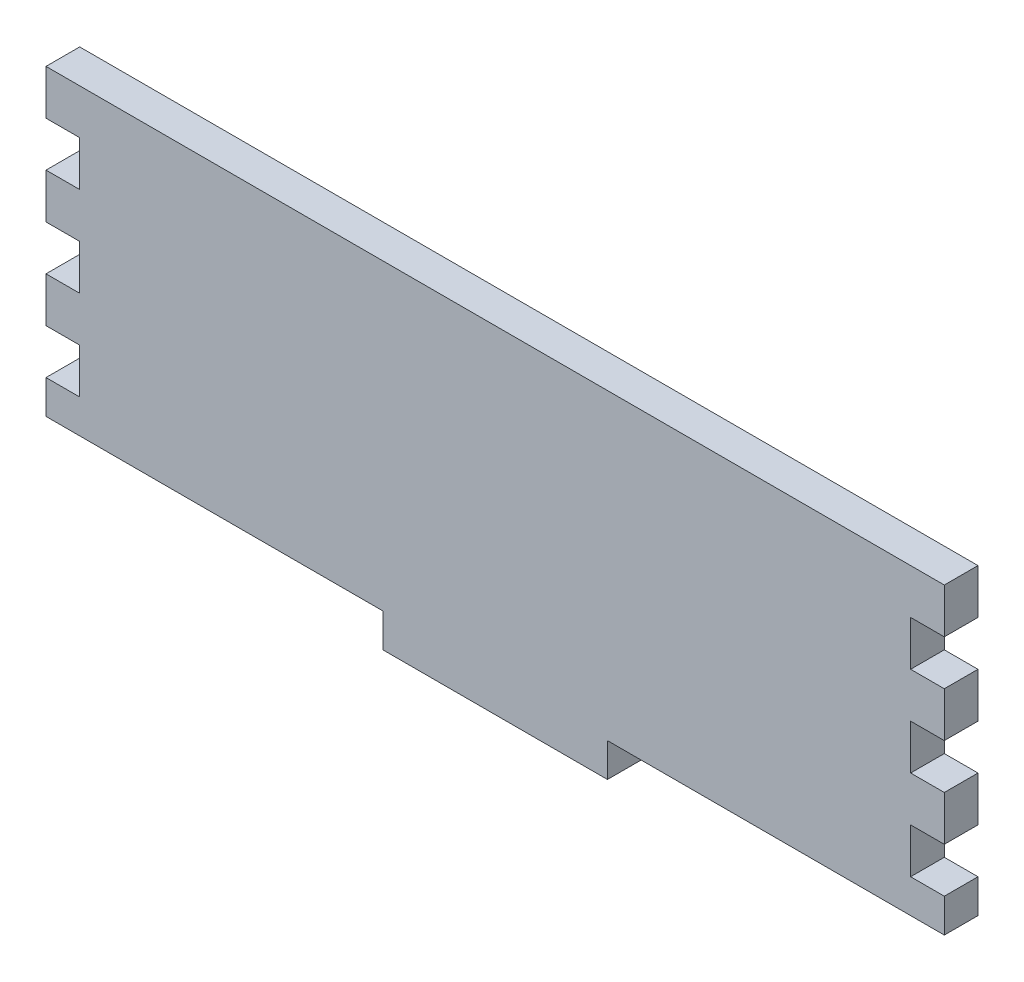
ISO-10303-21;
HEADER;
FILE_DESCRIPTION(('STEP AP214'),'2;1');
FILE_NAME('part.step','',(''),(''),'','','');
FILE_SCHEMA(('AUTOMOTIVE_DESIGN { 1 0 10303 214 1 1 1 1 }'));
ENDSEC;
DATA;
#1=APPLICATION_CONTEXT('core data for automotive mechanical design processes');
#2=APPLICATION_PROTOCOL_DEFINITION('international standard','automotive_design',2000,#1);
#3=PRODUCT_CONTEXT('',#1,'mechanical');
#4=PRODUCT('Part','Part','',(#3));
#5=PRODUCT_RELATED_PRODUCT_CATEGORY('part','',(#4));
#6=PRODUCT_DEFINITION_FORMATION('','',#4);
#7=PRODUCT_DEFINITION_CONTEXT('part definition',#1,'design');
#8=PRODUCT_DEFINITION('design','',#6,#7);
#9=PRODUCT_DEFINITION_SHAPE('','',#8);
#10=(LENGTH_UNIT() NAMED_UNIT(*) SI_UNIT(.MILLI.,.METRE.));
#11=(NAMED_UNIT(*) PLANE_ANGLE_UNIT() SI_UNIT($,.RADIAN.));
#12=(NAMED_UNIT(*) SI_UNIT($,.STERADIAN.) SOLID_ANGLE_UNIT());
#13=UNCERTAINTY_MEASURE_WITH_UNIT(LENGTH_MEASURE(1.E-05),#10,'distance_accuracy_value','');
#14=(GEOMETRIC_REPRESENTATION_CONTEXT(3) GLOBAL_UNCERTAINTY_ASSIGNED_CONTEXT((#13)) GLOBAL_UNIT_ASSIGNED_CONTEXT((#10,
#11,#12)) REPRESENTATION_CONTEXT('',''));
#15=CARTESIAN_POINT('',(0.,0.,0.));
#16=DIRECTION('',(0.,0.,1.));
#17=DIRECTION('',(1.,0.,0.));
#18=AXIS2_PLACEMENT_3D('',#15,#16,#17);
#19=CARTESIAN_POINT('',(-200.,-60.,15.));
#20=DIRECTION('',(1.,0.,0.));
#21=DIRECTION('',(0.,0.,-1.));
#22=AXIS2_PLACEMENT_3D('',#19,#20,#21);
#23=PLANE('',#22);
#24=DIRECTION('',(0.,-1.,0.));
#25=VECTOR('',#24,1.);
#26=CARTESIAN_POINT('',(-200.,-60.,0.));
#27=LINE('',#26,#25);
#28=CARTESIAN_POINT('',(-200.,35.,0.));
#29=VERTEX_POINT('',#28);
#30=CARTESIAN_POINT('',(-200.,15.,0.));
#31=VERTEX_POINT('',#30);
#32=EDGE_CURVE('E266',#29,#31,#27,.T.);
#33=ORIENTED_EDGE('',*,*,#32,.T.);
#34=DIRECTION('',(0.,0.,1.));
#35=VECTOR('',#34,1.);
#36=CARTESIAN_POINT('',(-200.,15.,0.));
#37=LINE('',#36,#35);
#38=CARTESIAN_POINT('',(-200.,15.,15.));
#39=VERTEX_POINT('',#38);
#40=EDGE_CURVE('E403',#31,#39,#37,.T.);
#41=ORIENTED_EDGE('',*,*,#40,.T.);
#42=DIRECTION('',(0.,-1.,0.));
#43=VECTOR('',#42,1.);
#44=CARTESIAN_POINT('',(-200.,-60.,15.));
#45=LINE('',#44,#43);
#46=CARTESIAN_POINT('',(-200.,35.,15.));
#47=VERTEX_POINT('',#46);
#48=EDGE_CURVE('E418',#47,#39,#45,.T.);
#49=ORIENTED_EDGE('',*,*,#48,.F.);
#50=DIRECTION('',(0.,0.,1.));
#51=VECTOR('',#50,1.);
#52=CARTESIAN_POINT('',(-200.,35.,0.));
#53=LINE('',#52,#51);
#54=EDGE_CURVE('E398',#29,#47,#53,.T.);
#55=ORIENTED_EDGE('',*,*,#54,.F.);
#56=EDGE_LOOP('',(#33,#41,#49,#55));
#57=FACE_BOUND('',#56,.T.);
#58=ADVANCED_FACE('F33',(#57),#23,.F.);
#59=CARTESIAN_POINT('',(-200.,-4.99999999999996,15.));
#60=VERTEX_POINT('',#59);
#61=CARTESIAN_POINT('',(-200.,-25.,15.));
#62=VERTEX_POINT('',#61);
#63=EDGE_CURVE('E259',#60,#62,#45,.T.);
#64=ORIENTED_EDGE('',*,*,#63,.F.);
#65=DIRECTION('',(0.,0.,1.));
#66=VECTOR('',#65,1.);
#67=CARTESIAN_POINT('',(-200.,-4.99999999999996,0.));
#68=LINE('',#67,#66);
#69=CARTESIAN_POINT('',(-200.,-4.99999999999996,0.));
#70=VERTEX_POINT('',#69);
#71=EDGE_CURVE('E245',#70,#60,#68,.T.);
#72=ORIENTED_EDGE('',*,*,#71,.F.);
#73=CARTESIAN_POINT('',(-200.,-25.,0.));
#74=VERTEX_POINT('',#73);
#75=EDGE_CURVE('E257',#70,#74,#27,.T.);
#76=ORIENTED_EDGE('',*,*,#75,.T.);
#77=DIRECTION('',(0.,0.,1.));
#78=VECTOR('',#77,1.);
#79=CARTESIAN_POINT('',(-200.,-25.,0.));
#80=LINE('',#79,#78);
#81=EDGE_CURVE('E443',#74,#62,#80,.T.);
#82=ORIENTED_EDGE('',*,*,#81,.T.);
#83=EDGE_LOOP('',(#64,#72,#76,#82));
#84=FACE_BOUND('',#83,.T.);
#85=ADVANCED_FACE('F255',(#84),#23,.F.);
#86=CARTESIAN_POINT('',(200.,-60.,15.));
#87=DIRECTION('',(-1.,0.,0.));
#88=DIRECTION('',(0.,0.,1.));
#89=AXIS2_PLACEMENT_3D('',#86,#87,#88);
#90=PLANE('',#89);
#91=DIRECTION('',(0.,1.,0.));
#92=VECTOR('',#91,1.);
#93=CARTESIAN_POINT('',(200.,-60.,0.));
#94=LINE('',#93,#92);
#95=CARTESIAN_POINT('',(200.,-60.,0.));
#96=VERTEX_POINT('',#95);
#97=CARTESIAN_POINT('',(200.,-45.0000000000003,0.));
#98=VERTEX_POINT('',#97);
#99=EDGE_CURVE('E288',#96,#98,#94,.T.);
#100=ORIENTED_EDGE('',*,*,#99,.T.);
#101=DIRECTION('',(0.,0.,1.));
#102=VECTOR('',#101,1.);
#103=CARTESIAN_POINT('',(200.,-45.0000000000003,0.));
#104=LINE('',#103,#102);
#105=CARTESIAN_POINT('',(200.,-45.0000000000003,15.));
#106=VERTEX_POINT('',#105);
#107=EDGE_CURVE('E461',#98,#106,#104,.T.);
#108=ORIENTED_EDGE('',*,*,#107,.T.);
#109=DIRECTION('',(0.,1.,0.));
#110=VECTOR('',#109,1.);
#111=CARTESIAN_POINT('',(200.,-60.,15.));
#112=LINE('',#111,#110);
#113=CARTESIAN_POINT('',(200.,-60.,15.));
#114=VERTEX_POINT('',#113);
#115=EDGE_CURVE('E345',#114,#106,#112,.T.);
#116=ORIENTED_EDGE('',*,*,#115,.F.);
#117=DIRECTION('',(0.,0.,-1.));
#118=VECTOR('',#117,1.);
#119=CARTESIAN_POINT('',(200.,-60.,15.));
#120=LINE('',#119,#118);
#121=EDGE_CURVE('E301',#114,#96,#120,.T.);
#122=ORIENTED_EDGE('',*,*,#121,.T.);
#123=EDGE_LOOP('',(#100,#108,#116,#122));
#124=FACE_BOUND('',#123,.T.);
#125=ADVANCED_FACE('F578',(#124),#90,.F.);
#126=CARTESIAN_POINT('',(200.,-25.0000000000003,15.));
#127=VERTEX_POINT('',#126);
#128=CARTESIAN_POINT('',(200.,-5.00000000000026,15.));
#129=VERTEX_POINT('',#128);
#130=EDGE_CURVE('E347',#127,#129,#112,.T.);
#131=ORIENTED_EDGE('',*,*,#130,.F.);
#132=DIRECTION('',(0.,0.,1.));
#133=VECTOR('',#132,1.);
#134=CARTESIAN_POINT('',(200.,-25.0000000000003,0.));
#135=LINE('',#134,#133);
#136=CARTESIAN_POINT('',(200.,-25.0000000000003,0.));
#137=VERTEX_POINT('',#136);
#138=EDGE_CURVE('E473',#137,#127,#135,.T.);
#139=ORIENTED_EDGE('',*,*,#138,.F.);
#140=CARTESIAN_POINT('',(200.,-5.00000000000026,0.));
#141=VERTEX_POINT('',#140);
#142=EDGE_CURVE('E292',#137,#141,#94,.T.);
#143=ORIENTED_EDGE('',*,*,#142,.T.);
#144=DIRECTION('',(0.,0.,1.));
#145=VECTOR('',#144,1.);
#146=CARTESIAN_POINT('',(200.,-5.00000000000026,0.));
#147=LINE('',#146,#145);
#148=EDGE_CURVE('E487',#141,#129,#147,.T.);
#149=ORIENTED_EDGE('',*,*,#148,.T.);
#150=EDGE_LOOP('',(#131,#139,#143,#149));
#151=FACE_BOUND('',#150,.T.);
#152=ADVANCED_FACE('F587',(#151),#90,.F.);
#153=CARTESIAN_POINT('',(200.,14.9999999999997,15.));
#154=VERTEX_POINT('',#153);
#155=CARTESIAN_POINT('',(200.,34.9999999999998,15.));
#156=VERTEX_POINT('',#155);
#157=EDGE_CURVE('E351',#154,#156,#112,.T.);
#158=ORIENTED_EDGE('',*,*,#157,.F.);
#159=DIRECTION('',(0.,0.,1.));
#160=VECTOR('',#159,1.);
#161=CARTESIAN_POINT('',(200.,14.9999999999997,0.));
#162=LINE('',#161,#160);
#163=CARTESIAN_POINT('',(200.,14.9999999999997,0.));
#164=VERTEX_POINT('',#163);
#165=EDGE_CURVE('E371',#164,#154,#162,.T.);
#166=ORIENTED_EDGE('',*,*,#165,.F.);
#167=CARTESIAN_POINT('',(200.,34.9999999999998,0.));
#168=VERTEX_POINT('',#167);
#169=EDGE_CURVE('E374',#164,#168,#94,.T.);
#170=ORIENTED_EDGE('',*,*,#169,.T.);
#171=DIRECTION('',(0.,0.,1.));
#172=VECTOR('',#171,1.);
#173=CARTESIAN_POINT('',(200.,34.9999999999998,0.));
#174=LINE('',#173,#172);
#175=EDGE_CURVE('E373',#168,#156,#174,.T.);
#176=ORIENTED_EDGE('',*,*,#175,.T.);
#177=EDGE_LOOP('',(#158,#166,#170,#176));
#178=FACE_BOUND('',#177,.T.);
#179=ADVANCED_FACE('F369',(#178),#90,.F.);
#180=CARTESIAN_POINT('',(-200.,75.,0.));
#181=VERTEX_POINT('',#180);
#182=CARTESIAN_POINT('',(-200.,55.,0.));
#183=VERTEX_POINT('',#182);
#184=EDGE_CURVE('E270',#181,#183,#27,.T.);
#185=ORIENTED_EDGE('',*,*,#184,.T.);
#186=DIRECTION('',(0.,0.,1.));
#187=VECTOR('',#186,1.);
#188=CARTESIAN_POINT('',(-200.,55.,0.));
#189=LINE('',#188,#187);
#190=CARTESIAN_POINT('',(-200.,55.,15.));
#191=VERTEX_POINT('',#190);
#192=EDGE_CURVE('E271',#183,#191,#189,.T.);
#193=ORIENTED_EDGE('',*,*,#192,.T.);
#194=CARTESIAN_POINT('',(-200.,75.,15.));
#195=VERTEX_POINT('',#194);
#196=EDGE_CURVE('E414',#195,#191,#45,.T.);
#197=ORIENTED_EDGE('',*,*,#196,.F.);
#198=DIRECTION('',(0.,0.,-1.));
#199=VECTOR('',#198,1.);
#200=CARTESIAN_POINT('',(-200.,75.,15.));
#201=LINE('',#200,#199);
#202=EDGE_CURVE('E295',#195,#181,#201,.T.);
#203=ORIENTED_EDGE('',*,*,#202,.T.);
#204=EDGE_LOOP('',(#185,#193,#197,#203));
#205=FACE_BOUND('',#204,.T.);
#206=ADVANCED_FACE('F529',(#205),#23,.F.);
#207=CARTESIAN_POINT('',(-200.,-45.,15.));
#208=VERTEX_POINT('',#207);
#209=CARTESIAN_POINT('',(-200.,-60.,15.));
#210=VERTEX_POINT('',#209);
#211=EDGE_CURVE('E294',#208,#210,#45,.T.);
#212=ORIENTED_EDGE('',*,*,#211,.F.);
#213=DIRECTION('',(0.,0.,1.));
#214=VECTOR('',#213,1.);
#215=CARTESIAN_POINT('',(-200.,-45.,0.));
#216=LINE('',#215,#214);
#217=CARTESIAN_POINT('',(-200.,-45.,0.));
#218=VERTEX_POINT('',#217);
#219=EDGE_CURVE('E425',#218,#208,#216,.T.);
#220=ORIENTED_EDGE('',*,*,#219,.F.);
#221=CARTESIAN_POINT('',(-200.,-60.,0.));
#222=VERTEX_POINT('',#221);
#223=EDGE_CURVE('E267',#218,#222,#27,.T.);
#224=ORIENTED_EDGE('',*,*,#223,.T.);
#225=DIRECTION('',(0.,0.,-1.));
#226=VECTOR('',#225,1.);
#227=CARTESIAN_POINT('',(-200.,-60.,15.));
#228=LINE('',#227,#226);
#229=EDGE_CURVE('E11',#210,#222,#228,.T.);
#230=ORIENTED_EDGE('',*,*,#229,.F.);
#231=EDGE_LOOP('',(#212,#220,#224,#230));
#232=FACE_BOUND('',#231,.T.);
#233=ADVANCED_FACE('F35',(#232),#23,.F.);
#234=CARTESIAN_POINT('',(-200.,-60.,15.));
#235=DIRECTION('',(0.,1.,0.));
#236=DIRECTION('',(0.,0.,1.));
#237=AXIS2_PLACEMENT_3D('',#234,#235,#236);
#238=PLANE('',#237);
#239=DIRECTION('',(1.,0.,0.));
#240=VECTOR('',#239,1.);
#241=CARTESIAN_POINT('',(-200.,-60.,0.));
#242=LINE('',#241,#240);
#243=CARTESIAN_POINT('',(-50.,-60.,0.));
#244=VERTEX_POINT('',#243);
#245=EDGE_CURVE('E275',#222,#244,#242,.T.);
#246=ORIENTED_EDGE('',*,*,#245,.T.);
#247=DIRECTION('',(0.,0.,-1.));
#248=VECTOR('',#247,1.);
#249=CARTESIAN_POINT('',(-50.,-60.,15.));
#250=LINE('',#249,#248);
#251=CARTESIAN_POINT('',(-50.,-60.,15.));
#252=VERTEX_POINT('',#251);
#253=EDGE_CURVE('E41',#252,#244,#250,.T.);
#254=ORIENTED_EDGE('',*,*,#253,.F.);
#255=DIRECTION('',(1.,0.,0.));
#256=VECTOR('',#255,1.);
#257=CARTESIAN_POINT('',(-200.,-60.,15.));
#258=LINE('',#257,#256);
#259=EDGE_CURVE('E417',#210,#252,#258,.T.);
#260=ORIENTED_EDGE('',*,*,#259,.F.);
#261=ORIENTED_EDGE('',*,*,#229,.T.);
#262=EDGE_LOOP('',(#246,#254,#260,#261));
#263=FACE_BOUND('',#262,.T.);
#264=ADVANCED_FACE('F422',(#263),#238,.F.);
#265=CARTESIAN_POINT('',(-50.,-60.,15.));
#266=DIRECTION('',(1.,0.,0.));
#267=DIRECTION('',(0.,1.,0.));
#268=AXIS2_PLACEMENT_3D('',#265,#266,#267);
#269=PLANE('',#268);
#270=DIRECTION('',(0.,-1.,0.));
#271=VECTOR('',#270,1.);
#272=CARTESIAN_POINT('',(-50.,-60.,0.));
#273=LINE('',#272,#271);
#274=CARTESIAN_POINT('',(-50.,-75.,0.));
#275=VERTEX_POINT('',#274);
#276=EDGE_CURVE('E279',#244,#275,#273,.T.);
#277=ORIENTED_EDGE('',*,*,#276,.T.);
#278=DIRECTION('',(0.,0.,-1.));
#279=VECTOR('',#278,1.);
#280=CARTESIAN_POINT('',(-50.,-75.,15.));
#281=LINE('',#280,#279);
#282=CARTESIAN_POINT('',(-50.,-75.,15.));
#283=VERTEX_POINT('',#282);
#284=EDGE_CURVE('E310',#283,#275,#281,.T.);
#285=ORIENTED_EDGE('',*,*,#284,.F.);
#286=DIRECTION('',(0.,-1.,0.));
#287=VECTOR('',#286,1.);
#288=CARTESIAN_POINT('',(-50.,-60.,15.));
#289=LINE('',#288,#287);
#290=EDGE_CURVE('E319',#252,#283,#289,.T.);
#291=ORIENTED_EDGE('',*,*,#290,.F.);
#292=ORIENTED_EDGE('',*,*,#253,.T.);
#293=EDGE_LOOP('',(#277,#285,#291,#292));
#294=FACE_BOUND('',#293,.T.);
#295=ADVANCED_FACE('F317',(#294),#269,.F.);
#296=CARTESIAN_POINT('',(-50.,-75.,15.));
#297=DIRECTION('',(0.,1.,0.));
#298=DIRECTION('',(0.,0.,1.));
#299=AXIS2_PLACEMENT_3D('',#296,#297,#298);
#300=PLANE('',#299);
#301=DIRECTION('',(1.,0.,0.));
#302=VECTOR('',#301,1.);
#303=CARTESIAN_POINT('',(-50.,-75.,0.));
#304=LINE('',#303,#302);
#305=CARTESIAN_POINT('',(50.,-75.,0.));
#306=VERTEX_POINT('',#305);
#307=EDGE_CURVE('E281',#275,#306,#304,.T.);
#308=ORIENTED_EDGE('',*,*,#307,.T.);
#309=DIRECTION('',(0.,0.,-1.));
#310=VECTOR('',#309,1.);
#311=CARTESIAN_POINT('',(50.,-75.,15.));
#312=LINE('',#311,#310);
#313=CARTESIAN_POINT('',(50.,-75.,15.));
#314=VERTEX_POINT('',#313);
#315=EDGE_CURVE('E307',#314,#306,#312,.T.);
#316=ORIENTED_EDGE('',*,*,#315,.F.);
#317=DIRECTION('',(1.,0.,0.));
#318=VECTOR('',#317,1.);
#319=CARTESIAN_POINT('',(-50.,-75.,15.));
#320=LINE('',#319,#318);
#321=EDGE_CURVE('E339',#283,#314,#320,.T.);
#322=ORIENTED_EDGE('',*,*,#321,.F.);
#323=ORIENTED_EDGE('',*,*,#284,.T.);
#324=EDGE_LOOP('',(#308,#316,#322,#323));
#325=FACE_BOUND('',#324,.T.);
#326=ADVANCED_FACE('F329',(#325),#300,.F.);
#327=CARTESIAN_POINT('',(50.,-75.,15.));
#328=DIRECTION('',(-1.,0.,0.));
#329=DIRECTION('',(0.,-1.,0.));
#330=AXIS2_PLACEMENT_3D('',#327,#328,#329);
#331=PLANE('',#330);
#332=DIRECTION('',(0.,1.,0.));
#333=VECTOR('',#332,1.);
#334=CARTESIAN_POINT('',(50.,-75.,0.));
#335=LINE('',#334,#333);
#336=CARTESIAN_POINT('',(50.,-60.,0.));
#337=VERTEX_POINT('',#336);
#338=EDGE_CURVE('E283',#306,#337,#335,.T.);
#339=ORIENTED_EDGE('',*,*,#338,.T.);
#340=DIRECTION('',(0.,0.,-1.));
#341=VECTOR('',#340,1.);
#342=CARTESIAN_POINT('',(50.,-60.,15.));
#343=LINE('',#342,#341);
#344=CARTESIAN_POINT('',(50.,-60.,15.));
#345=VERTEX_POINT('',#344);
#346=EDGE_CURVE('E304',#345,#337,#343,.T.);
#347=ORIENTED_EDGE('',*,*,#346,.F.);
#348=DIRECTION('',(0.,1.,0.));
#349=VECTOR('',#348,1.);
#350=CARTESIAN_POINT('',(50.,-75.,15.));
#351=LINE('',#350,#349);
#352=EDGE_CURVE('E335',#314,#345,#351,.T.);
#353=ORIENTED_EDGE('',*,*,#352,.F.);
#354=ORIENTED_EDGE('',*,*,#315,.T.);
#355=EDGE_LOOP('',(#339,#347,#353,#354));
#356=FACE_BOUND('',#355,.T.);
#357=ADVANCED_FACE('F333',(#356),#331,.F.);
#358=CARTESIAN_POINT('',(50.,-60.,15.));
#359=DIRECTION('',(0.,1.,0.));
#360=DIRECTION('',(0.,0.,1.));
#361=AXIS2_PLACEMENT_3D('',#358,#359,#360);
#362=PLANE('',#361);
#363=DIRECTION('',(1.,0.,0.));
#364=VECTOR('',#363,1.);
#365=CARTESIAN_POINT('',(50.,-60.,0.));
#366=LINE('',#365,#364);
#367=EDGE_CURVE('E285',#337,#96,#366,.T.);
#368=ORIENTED_EDGE('',*,*,#367,.T.);
#369=ORIENTED_EDGE('',*,*,#121,.F.);
#370=DIRECTION('',(1.,0.,0.));
#371=VECTOR('',#370,1.);
#372=CARTESIAN_POINT('',(50.,-60.,15.));
#373=LINE('',#372,#371);
#374=EDGE_CURVE('E338',#345,#114,#373,.T.);
#375=ORIENTED_EDGE('',*,*,#374,.F.);
#376=ORIENTED_EDGE('',*,*,#346,.T.);
#377=EDGE_LOOP('',(#368,#369,#375,#376));
#378=FACE_BOUND('',#377,.T.);
#379=ADVANCED_FACE('F596',(#378),#362,.F.);
#380=CARTESIAN_POINT('',(200.,54.9999999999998,15.));
#381=VERTEX_POINT('',#380);
#382=CARTESIAN_POINT('',(200.,75.0000000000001,15.));
#383=VERTEX_POINT('',#382);
#384=EDGE_CURVE('E341',#381,#383,#112,.T.);
#385=ORIENTED_EDGE('',*,*,#384,.F.);
#386=DIRECTION('',(0.,0.,1.));
#387=VECTOR('',#386,1.);
#388=CARTESIAN_POINT('',(200.,54.9999999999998,0.));
#389=LINE('',#388,#387);
#390=CARTESIAN_POINT('',(200.,54.9999999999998,0.));
#391=VERTEX_POINT('',#390);
#392=EDGE_CURVE('E378',#391,#381,#389,.T.);
#393=ORIENTED_EDGE('',*,*,#392,.F.);
#394=CARTESIAN_POINT('',(200.,75.0000000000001,0.));
#395=VERTEX_POINT('',#394);
#396=EDGE_CURVE('E287',#391,#395,#94,.T.);
#397=ORIENTED_EDGE('',*,*,#396,.T.);
#398=DIRECTION('',(0.,0.,-1.));
#399=VECTOR('',#398,1.);
#400=CARTESIAN_POINT('',(200.,75.0000000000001,15.));
#401=LINE('',#400,#399);
#402=EDGE_CURVE('E298',#383,#395,#401,.T.);
#403=ORIENTED_EDGE('',*,*,#402,.F.);
#404=EDGE_LOOP('',(#385,#393,#397,#403));
#405=FACE_BOUND('',#404,.T.);
#406=ADVANCED_FACE('F518',(#405),#90,.F.);
#407=CARTESIAN_POINT('',(200.,75.0000000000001,15.));
#408=DIRECTION('',(0.,-1.,0.));
#409=DIRECTION('',(1.,0.,0.));
#410=AXIS2_PLACEMENT_3D('',#407,#408,#409);
#411=PLANE('',#410);
#412=DIRECTION('',(-1.,0.,0.));
#413=VECTOR('',#412,1.);
#414=CARTESIAN_POINT('',(200.,75.0000000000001,0.));
#415=LINE('',#414,#413);
#416=EDGE_CURVE('E291',#395,#181,#415,.T.);
#417=ORIENTED_EDGE('',*,*,#416,.T.);
#418=ORIENTED_EDGE('',*,*,#202,.F.);
#419=DIRECTION('',(-1.,0.,0.));
#420=VECTOR('',#419,1.);
#421=CARTESIAN_POINT('',(200.,75.0000000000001,15.));
#422=LINE('',#421,#420);
#423=EDGE_CURVE('E276',#383,#195,#422,.T.);
#424=ORIENTED_EDGE('',*,*,#423,.F.);
#425=ORIENTED_EDGE('',*,*,#402,.T.);
#426=EDGE_LOOP('',(#417,#418,#424,#425));
#427=FACE_BOUND('',#426,.T.);
#428=ADVANCED_FACE('F524',(#427),#411,.F.);
#429=CARTESIAN_POINT('',(0.,0.,15.));
#430=DIRECTION('',(0.,0.,1.));
#431=DIRECTION('',(1.,0.,0.));
#432=AXIS2_PLACEMENT_3D('',#429,#430,#431);
#433=PLANE('',#432);
#434=DIRECTION('',(-1.,0.,0.));
#435=VECTOR('',#434,1.);
#436=CARTESIAN_POINT('',(-200.,15.,15.));
#437=LINE('',#436,#435);
#438=CARTESIAN_POINT('',(-185.,15.,15.));
#439=VERTEX_POINT('',#438);
#440=EDGE_CURVE('E250',#439,#39,#437,.T.);
#441=ORIENTED_EDGE('',*,*,#440,.F.);
#442=DIRECTION('',(0.,1.,0.));
#443=VECTOR('',#442,1.);
#444=CARTESIAN_POINT('',(-185.,15.,15.));
#445=LINE('',#444,#443);
#446=CARTESIAN_POINT('',(-185.,-4.99999999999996,15.));
#447=VERTEX_POINT('',#446);
#448=EDGE_CURVE('E550',#447,#439,#445,.T.);
#449=ORIENTED_EDGE('',*,*,#448,.F.);
#450=DIRECTION('',(1.,0.,0.));
#451=VECTOR('',#450,1.);
#452=CARTESIAN_POINT('',(-185.,-4.99999999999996,15.));
#453=LINE('',#452,#451);
#454=EDGE_CURVE('E445',#60,#447,#453,.T.);
#455=ORIENTED_EDGE('',*,*,#454,.F.);
#456=ORIENTED_EDGE('',*,*,#63,.T.);
#457=DIRECTION('',(-1.,0.,0.));
#458=VECTOR('',#457,1.);
#459=CARTESIAN_POINT('',(-200.,-25.,15.));
#460=LINE('',#459,#458);
#461=CARTESIAN_POINT('',(-185.,-25.,15.));
#462=VERTEX_POINT('',#461);
#463=EDGE_CURVE('E429',#462,#62,#460,.T.);
#464=ORIENTED_EDGE('',*,*,#463,.F.);
#465=DIRECTION('',(0.,1.,0.));
#466=VECTOR('',#465,1.);
#467=CARTESIAN_POINT('',(-185.,-25.,15.));
#468=LINE('',#467,#466);
#469=CARTESIAN_POINT('',(-185.,-45.,15.));
#470=VERTEX_POINT('',#469);
#471=EDGE_CURVE('E432',#470,#462,#468,.T.);
#472=ORIENTED_EDGE('',*,*,#471,.F.);
#473=DIRECTION('',(1.,0.,0.));
#474=VECTOR('',#473,1.);
#475=CARTESIAN_POINT('',(-185.,-45.,15.));
#476=LINE('',#475,#474);
#477=EDGE_CURVE('E437',#208,#470,#476,.T.);
#478=ORIENTED_EDGE('',*,*,#477,.F.);
#479=ORIENTED_EDGE('',*,*,#211,.T.);
#480=ORIENTED_EDGE('',*,*,#259,.T.);
#481=ORIENTED_EDGE('',*,*,#290,.T.);
#482=ORIENTED_EDGE('',*,*,#321,.T.);
#483=ORIENTED_EDGE('',*,*,#352,.T.);
#484=ORIENTED_EDGE('',*,*,#374,.T.);
#485=ORIENTED_EDGE('',*,*,#115,.T.);
#486=DIRECTION('',(1.,0.,0.));
#487=VECTOR('',#486,1.);
#488=CARTESIAN_POINT('',(185.,-45.0000000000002,15.));
#489=LINE('',#488,#487);
#490=CARTESIAN_POINT('',(185.,-45.0000000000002,15.));
#491=VERTEX_POINT('',#490);
#492=EDGE_CURVE('E462',#491,#106,#489,.T.);
#493=ORIENTED_EDGE('',*,*,#492,.F.);
#494=DIRECTION('',(0.,-1.,0.));
#495=VECTOR('',#494,1.);
#496=CARTESIAN_POINT('',(185.,-25.0000000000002,15.));
#497=LINE('',#496,#495);
#498=CARTESIAN_POINT('',(185.,-25.0000000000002,15.));
#499=VERTEX_POINT('',#498);
#500=EDGE_CURVE('E455',#499,#491,#497,.T.);
#501=ORIENTED_EDGE('',*,*,#500,.F.);
#502=DIRECTION('',(-1.,0.,0.));
#503=VECTOR('',#502,1.);
#504=CARTESIAN_POINT('',(200.,-25.0000000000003,15.));
#505=LINE('',#504,#503);
#506=EDGE_CURVE('E464',#127,#499,#505,.T.);
#507=ORIENTED_EDGE('',*,*,#506,.F.);
#508=ORIENTED_EDGE('',*,*,#130,.T.);
#509=DIRECTION('',(1.,0.,0.));
#510=VECTOR('',#509,1.);
#511=CARTESIAN_POINT('',(185.,-5.00000000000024,15.));
#512=LINE('',#511,#510);
#513=CARTESIAN_POINT('',(185.,-5.00000000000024,15.));
#514=VERTEX_POINT('',#513);
#515=EDGE_CURVE('E488',#514,#129,#512,.T.);
#516=ORIENTED_EDGE('',*,*,#515,.F.);
#517=DIRECTION('',(0.,-1.,0.));
#518=VECTOR('',#517,1.);
#519=CARTESIAN_POINT('',(185.,14.9999999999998,15.));
#520=LINE('',#519,#518);
#521=CARTESIAN_POINT('',(185.,14.9999999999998,15.));
#522=VERTEX_POINT('',#521);
#523=EDGE_CURVE('E481',#522,#514,#520,.T.);
#524=ORIENTED_EDGE('',*,*,#523,.F.);
#525=DIRECTION('',(-1.,0.,0.));
#526=VECTOR('',#525,1.);
#527=CARTESIAN_POINT('',(200.,14.9999999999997,15.));
#528=LINE('',#527,#526);
#529=EDGE_CURVE('E365',#154,#522,#528,.T.);
#530=ORIENTED_EDGE('',*,*,#529,.F.);
#531=ORIENTED_EDGE('',*,*,#157,.T.);
#532=DIRECTION('',(1.,0.,0.));
#533=VECTOR('',#532,1.);
#534=CARTESIAN_POINT('',(185.,34.9999999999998,15.));
#535=LINE('',#534,#533);
#536=CARTESIAN_POINT('',(185.,34.9999999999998,15.));
#537=VERTEX_POINT('',#536);
#538=EDGE_CURVE('E362',#537,#156,#535,.T.);
#539=ORIENTED_EDGE('',*,*,#538,.F.);
#540=DIRECTION('',(0.,-1.,0.));
#541=VECTOR('',#540,1.);
#542=CARTESIAN_POINT('',(185.,54.9999999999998,15.));
#543=LINE('',#542,#541);
#544=CARTESIAN_POINT('',(185.,54.9999999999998,15.));
#545=VERTEX_POINT('',#544);
#546=EDGE_CURVE('E502',#545,#537,#543,.T.);
#547=ORIENTED_EDGE('',*,*,#546,.F.);
#548=DIRECTION('',(-1.,0.,0.));
#549=VECTOR('',#548,1.);
#550=CARTESIAN_POINT('',(200.,54.9999999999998,15.));
#551=LINE('',#550,#549);
#552=EDGE_CURVE('E506',#381,#545,#551,.T.);
#553=ORIENTED_EDGE('',*,*,#552,.F.);
#554=ORIENTED_EDGE('',*,*,#384,.T.);
#555=ORIENTED_EDGE('',*,*,#423,.T.);
#556=ORIENTED_EDGE('',*,*,#196,.T.);
#557=DIRECTION('',(-1.,0.,0.));
#558=VECTOR('',#557,1.);
#559=CARTESIAN_POINT('',(-200.,55.,15.));
#560=LINE('',#559,#558);
#561=CARTESIAN_POINT('',(-185.,55.,15.));
#562=VERTEX_POINT('',#561);
#563=EDGE_CURVE('E392',#562,#191,#560,.T.);
#564=ORIENTED_EDGE('',*,*,#563,.F.);
#565=DIRECTION('',(0.,1.,0.));
#566=VECTOR('',#565,1.);
#567=CARTESIAN_POINT('',(-185.,55.,15.));
#568=LINE('',#567,#566);
#569=CARTESIAN_POINT('',(-185.,35.,15.));
#570=VERTEX_POINT('',#569);
#571=EDGE_CURVE('E402',#570,#562,#568,.T.);
#572=ORIENTED_EDGE('',*,*,#571,.F.);
#573=DIRECTION('',(1.,0.,0.));
#574=VECTOR('',#573,1.);
#575=CARTESIAN_POINT('',(-185.,35.,15.));
#576=LINE('',#575,#574);
#577=EDGE_CURVE('E399',#47,#570,#576,.T.);
#578=ORIENTED_EDGE('',*,*,#577,.F.);
#579=ORIENTED_EDGE('',*,*,#48,.T.);
#580=EDGE_LOOP('',(#441,#449,#455,#456,#464,#472,#478,#479,#480,#481,#482,#483,#484,#485,#493,
#501,#507,#508,#516,#524,#530,#531,#539,#547,#553,#554,#555,#556,#564,#572,#578,#579));
#581=FACE_BOUND('',#580,.T.);
#582=ADVANCED_FACE('F360',(#581),#433,.T.);
#583=CARTESIAN_POINT('',(0.,0.,0.));
#584=DIRECTION('',(0.,0.,1.));
#585=DIRECTION('',(1.,0.,0.));
#586=AXIS2_PLACEMENT_3D('',#583,#584,#585);
#587=PLANE('',#586);
#588=DIRECTION('',(0.,1.,0.));
#589=VECTOR('',#588,1.);
#590=CARTESIAN_POINT('',(-185.,15.,0.));
#591=LINE('',#590,#589);
#592=CARTESIAN_POINT('',(-185.,-4.99999999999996,0.));
#593=VERTEX_POINT('',#592);
#594=CARTESIAN_POINT('',(-185.,15.,0.));
#595=VERTEX_POINT('',#594);
#596=EDGE_CURVE('E48',#593,#595,#591,.T.);
#597=ORIENTED_EDGE('',*,*,#596,.T.);
#598=DIRECTION('',(-1.,0.,0.));
#599=VECTOR('',#598,1.);
#600=CARTESIAN_POINT('',(-200.,15.,0.));
#601=LINE('',#600,#599);
#602=EDGE_CURVE('E260',#595,#31,#601,.T.);
#603=ORIENTED_EDGE('',*,*,#602,.T.);
#604=ORIENTED_EDGE('',*,*,#32,.F.);
#605=DIRECTION('',(1.,0.,0.));
#606=VECTOR('',#605,1.);
#607=CARTESIAN_POINT('',(-185.,35.,0.));
#608=LINE('',#607,#606);
#609=CARTESIAN_POINT('',(-185.,35.,0.));
#610=VERTEX_POINT('',#609);
#611=EDGE_CURVE('E388',#29,#610,#608,.T.);
#612=ORIENTED_EDGE('',*,*,#611,.T.);
#613=DIRECTION('',(0.,1.,0.));
#614=VECTOR('',#613,1.);
#615=CARTESIAN_POINT('',(-185.,55.,0.));
#616=LINE('',#615,#614);
#617=CARTESIAN_POINT('',(-185.,55.,0.));
#618=VERTEX_POINT('',#617);
#619=EDGE_CURVE('E391',#610,#618,#616,.T.);
#620=ORIENTED_EDGE('',*,*,#619,.T.);
#621=DIRECTION('',(-1.,0.,0.));
#622=VECTOR('',#621,1.);
#623=CARTESIAN_POINT('',(-200.,55.,0.));
#624=LINE('',#623,#622);
#625=EDGE_CURVE('E395',#618,#183,#624,.T.);
#626=ORIENTED_EDGE('',*,*,#625,.T.);
#627=ORIENTED_EDGE('',*,*,#184,.F.);
#628=ORIENTED_EDGE('',*,*,#416,.F.);
#629=ORIENTED_EDGE('',*,*,#396,.F.);
#630=DIRECTION('',(-1.,0.,0.));
#631=VECTOR('',#630,1.);
#632=CARTESIAN_POINT('',(200.,54.9999999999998,0.));
#633=LINE('',#632,#631);
#634=CARTESIAN_POINT('',(185.,54.9999999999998,0.));
#635=VERTEX_POINT('',#634);
#636=EDGE_CURVE('E384',#391,#635,#633,.T.);
#637=ORIENTED_EDGE('',*,*,#636,.T.);
#638=DIRECTION('',(0.,-1.,0.));
#639=VECTOR('',#638,1.);
#640=CARTESIAN_POINT('',(185.,54.9999999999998,0.));
#641=LINE('',#640,#639);
#642=CARTESIAN_POINT('',(185.,34.9999999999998,0.));
#643=VERTEX_POINT('',#642);
#644=EDGE_CURVE('E379',#635,#643,#641,.T.);
#645=ORIENTED_EDGE('',*,*,#644,.T.);
#646=DIRECTION('',(1.,0.,0.));
#647=VECTOR('',#646,1.);
#648=CARTESIAN_POINT('',(185.,34.9999999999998,0.));
#649=LINE('',#648,#647);
#650=EDGE_CURVE('E500',#643,#168,#649,.T.);
#651=ORIENTED_EDGE('',*,*,#650,.T.);
#652=ORIENTED_EDGE('',*,*,#169,.F.);
#653=DIRECTION('',(-1.,0.,0.));
#654=VECTOR('',#653,1.);
#655=CARTESIAN_POINT('',(200.,14.9999999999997,0.));
#656=LINE('',#655,#654);
#657=CARTESIAN_POINT('',(185.,14.9999999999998,0.));
#658=VERTEX_POINT('',#657);
#659=EDGE_CURVE('E480',#164,#658,#656,.T.);
#660=ORIENTED_EDGE('',*,*,#659,.T.);
#661=DIRECTION('',(0.,-1.,0.));
#662=VECTOR('',#661,1.);
#663=CARTESIAN_POINT('',(185.,14.9999999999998,0.));
#664=LINE('',#663,#662);
#665=CARTESIAN_POINT('',(185.,-5.00000000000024,0.));
#666=VERTEX_POINT('',#665);
#667=EDGE_CURVE('E484',#658,#666,#664,.T.);
#668=ORIENTED_EDGE('',*,*,#667,.T.);
#669=DIRECTION('',(1.,0.,0.));
#670=VECTOR('',#669,1.);
#671=CARTESIAN_POINT('',(185.,-5.00000000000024,0.));
#672=LINE('',#671,#670);
#673=EDGE_CURVE('E477',#666,#141,#672,.T.);
#674=ORIENTED_EDGE('',*,*,#673,.T.);
#675=ORIENTED_EDGE('',*,*,#142,.F.);
#676=DIRECTION('',(-1.,0.,0.));
#677=VECTOR('',#676,1.);
#678=CARTESIAN_POINT('',(200.,-25.0000000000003,0.));
#679=LINE('',#678,#677);
#680=CARTESIAN_POINT('',(185.,-25.0000000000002,0.));
#681=VERTEX_POINT('',#680);
#682=EDGE_CURVE('E454',#137,#681,#679,.T.);
#683=ORIENTED_EDGE('',*,*,#682,.T.);
#684=DIRECTION('',(0.,-1.,0.));
#685=VECTOR('',#684,1.);
#686=CARTESIAN_POINT('',(185.,-25.0000000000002,0.));
#687=LINE('',#686,#685);
#688=CARTESIAN_POINT('',(185.,-45.0000000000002,0.));
#689=VERTEX_POINT('',#688);
#690=EDGE_CURVE('E458',#681,#689,#687,.T.);
#691=ORIENTED_EDGE('',*,*,#690,.T.);
#692=DIRECTION('',(1.,0.,0.));
#693=VECTOR('',#692,1.);
#694=CARTESIAN_POINT('',(185.,-45.0000000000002,0.));
#695=LINE('',#694,#693);
#696=EDGE_CURVE('E451',#689,#98,#695,.T.);
#697=ORIENTED_EDGE('',*,*,#696,.T.);
#698=ORIENTED_EDGE('',*,*,#99,.F.);
#699=ORIENTED_EDGE('',*,*,#367,.F.);
#700=ORIENTED_EDGE('',*,*,#338,.F.);
#701=ORIENTED_EDGE('',*,*,#307,.F.);
#702=ORIENTED_EDGE('',*,*,#276,.F.);
#703=ORIENTED_EDGE('',*,*,#245,.F.);
#704=ORIENTED_EDGE('',*,*,#223,.F.);
#705=DIRECTION('',(1.,0.,0.));
#706=VECTOR('',#705,1.);
#707=CARTESIAN_POINT('',(-185.,-45.,0.));
#708=LINE('',#707,#706);
#709=CARTESIAN_POINT('',(-185.,-45.,0.));
#710=VERTEX_POINT('',#709);
#711=EDGE_CURVE('E427',#218,#710,#708,.T.);
#712=ORIENTED_EDGE('',*,*,#711,.T.);
#713=DIRECTION('',(0.,1.,0.));
#714=VECTOR('',#713,1.);
#715=CARTESIAN_POINT('',(-185.,-25.,0.));
#716=LINE('',#715,#714);
#717=CARTESIAN_POINT('',(-185.,-25.,0.));
#718=VERTEX_POINT('',#717);
#719=EDGE_CURVE('E56',#710,#718,#716,.T.);
#720=ORIENTED_EDGE('',*,*,#719,.T.);
#721=DIRECTION('',(-1.,0.,0.));
#722=VECTOR('',#721,1.);
#723=CARTESIAN_POINT('',(-200.,-25.,0.));
#724=LINE('',#723,#722);
#725=EDGE_CURVE('E265',#718,#74,#724,.T.);
#726=ORIENTED_EDGE('',*,*,#725,.T.);
#727=ORIENTED_EDGE('',*,*,#75,.F.);
#728=DIRECTION('',(1.,0.,0.));
#729=VECTOR('',#728,1.);
#730=CARTESIAN_POINT('',(-185.,-4.99999999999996,0.));
#731=LINE('',#730,#729);
#732=EDGE_CURVE('E241',#70,#593,#731,.T.);
#733=ORIENTED_EDGE('',*,*,#732,.T.);
#734=EDGE_LOOP('',(#597,#603,#604,#612,#620,#626,#627,#628,#629,#637,#645,#651,#652,#660,#668,
#674,#675,#683,#691,#697,#698,#699,#700,#701,#702,#703,#704,#712,#720,#726,#727,#733));
#735=FACE_BOUND('',#734,.T.);
#736=ADVANCED_FACE('F263',(#735),#587,.F.);
#737=CARTESIAN_POINT('',(-200.,55.,0.));
#738=DIRECTION('',(0.,1.,0.));
#739=DIRECTION('',(0.,0.,1.));
#740=AXIS2_PLACEMENT_3D('',#737,#738,#739);
#741=PLANE('',#740);
#742=ORIENTED_EDGE('',*,*,#563,.T.);
#743=ORIENTED_EDGE('',*,*,#192,.F.);
#744=ORIENTED_EDGE('',*,*,#625,.F.);
#745=DIRECTION('',(0.,0.,1.));
#746=VECTOR('',#745,1.);
#747=CARTESIAN_POINT('',(-185.,55.,0.));
#748=LINE('',#747,#746);
#749=EDGE_CURVE('E409',#618,#562,#748,.T.);
#750=ORIENTED_EDGE('',*,*,#749,.T.);
#751=EDGE_LOOP('',(#742,#743,#744,#750));
#752=FACE_BOUND('',#751,.T.);
#753=ADVANCED_FACE('F533',(#752),#741,.F.);
#754=CARTESIAN_POINT('',(-185.,55.,0.));
#755=DIRECTION('',(1.,0.,0.));
#756=DIRECTION('',(0.,0.,-1.));
#757=AXIS2_PLACEMENT_3D('',#754,#755,#756);
#758=PLANE('',#757);
#759=ORIENTED_EDGE('',*,*,#571,.T.);
#760=ORIENTED_EDGE('',*,*,#749,.F.);
#761=ORIENTED_EDGE('',*,*,#619,.F.);
#762=DIRECTION('',(0.,0.,1.));
#763=VECTOR('',#762,1.);
#764=CARTESIAN_POINT('',(-185.,35.,0.));
#765=LINE('',#764,#763);
#766=EDGE_CURVE('E411',#610,#570,#765,.T.);
#767=ORIENTED_EDGE('',*,*,#766,.T.);
#768=EDGE_LOOP('',(#759,#760,#761,#767));
#769=FACE_BOUND('',#768,.T.);
#770=ADVANCED_FACE('F537',(#769),#758,.F.);
#771=CARTESIAN_POINT('',(-185.,35.,0.));
#772=DIRECTION('',(0.,-1.,0.));
#773=DIRECTION('',(0.,0.,-1.));
#774=AXIS2_PLACEMENT_3D('',#771,#772,#773);
#775=PLANE('',#774);
#776=ORIENTED_EDGE('',*,*,#577,.T.);
#777=ORIENTED_EDGE('',*,*,#766,.F.);
#778=ORIENTED_EDGE('',*,*,#611,.F.);
#779=ORIENTED_EDGE('',*,*,#54,.T.);
#780=EDGE_LOOP('',(#776,#777,#778,#779));
#781=FACE_BOUND('',#780,.T.);
#782=ADVANCED_FACE('F539',(#781),#775,.F.);
#783=CARTESIAN_POINT('',(185.,34.9999999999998,0.));
#784=DIRECTION('',(0.,-1.,0.));
#785=DIRECTION('',(1.,0.,0.));
#786=AXIS2_PLACEMENT_3D('',#783,#784,#785);
#787=PLANE('',#786);
#788=ORIENTED_EDGE('',*,*,#538,.T.);
#789=ORIENTED_EDGE('',*,*,#175,.F.);
#790=ORIENTED_EDGE('',*,*,#650,.F.);
#791=DIRECTION('',(0.,0.,1.));
#792=VECTOR('',#791,1.);
#793=CARTESIAN_POINT('',(185.,34.9999999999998,0.));
#794=LINE('',#793,#792);
#795=EDGE_CURVE('E490',#643,#537,#794,.T.);
#796=ORIENTED_EDGE('',*,*,#795,.T.);
#797=EDGE_LOOP('',(#788,#789,#790,#796));
#798=FACE_BOUND('',#797,.T.);
#799=ADVANCED_FACE('F631',(#798),#787,.F.);
#800=CARTESIAN_POINT('',(185.,54.9999999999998,0.));
#801=DIRECTION('',(-1.,0.,0.));
#802=DIRECTION('',(0.,0.,1.));
#803=AXIS2_PLACEMENT_3D('',#800,#801,#802);
#804=PLANE('',#803);
#805=ORIENTED_EDGE('',*,*,#546,.T.);
#806=ORIENTED_EDGE('',*,*,#795,.F.);
#807=ORIENTED_EDGE('',*,*,#644,.F.);
#808=DIRECTION('',(0.,0.,1.));
#809=VECTOR('',#808,1.);
#810=CARTESIAN_POINT('',(185.,54.9999999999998,0.));
#811=LINE('',#810,#809);
#812=EDGE_CURVE('E381',#635,#545,#811,.T.);
#813=ORIENTED_EDGE('',*,*,#812,.T.);
#814=EDGE_LOOP('',(#805,#806,#807,#813));
#815=FACE_BOUND('',#814,.T.);
#816=ADVANCED_FACE('F513',(#815),#804,.F.);
#817=CARTESIAN_POINT('',(200.,54.9999999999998,0.));
#818=DIRECTION('',(0.,1.,0.));
#819=DIRECTION('',(-1.,0.,0.));
#820=AXIS2_PLACEMENT_3D('',#817,#818,#819);
#821=PLANE('',#820);
#822=ORIENTED_EDGE('',*,*,#552,.T.);
#823=ORIENTED_EDGE('',*,*,#812,.F.);
#824=ORIENTED_EDGE('',*,*,#636,.F.);
#825=ORIENTED_EDGE('',*,*,#392,.T.);
#826=EDGE_LOOP('',(#822,#823,#824,#825));
#827=FACE_BOUND('',#826,.T.);
#828=ADVANCED_FACE('F515',(#827),#821,.F.);
#829=CARTESIAN_POINT('',(185.,-5.00000000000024,0.));
#830=DIRECTION('',(0.,-1.,0.));
#831=DIRECTION('',(1.,0.,0.));
#832=AXIS2_PLACEMENT_3D('',#829,#830,#831);
#833=PLANE('',#832);
#834=ORIENTED_EDGE('',*,*,#515,.T.);
#835=ORIENTED_EDGE('',*,*,#148,.F.);
#836=ORIENTED_EDGE('',*,*,#673,.F.);
#837=DIRECTION('',(0.,0.,1.));
#838=VECTOR('',#837,1.);
#839=CARTESIAN_POINT('',(185.,-5.00000000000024,0.));
#840=LINE('',#839,#838);
#841=EDGE_CURVE('E465',#666,#514,#840,.T.);
#842=ORIENTED_EDGE('',*,*,#841,.T.);
#843=EDGE_LOOP('',(#834,#835,#836,#842));
#844=FACE_BOUND('',#843,.T.);
#845=ADVANCED_FACE('F624',(#844),#833,.F.);
#846=CARTESIAN_POINT('',(185.,14.9999999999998,0.));
#847=DIRECTION('',(-1.,0.,0.));
#848=DIRECTION('',(0.,-1.,0.));
#849=AXIS2_PLACEMENT_3D('',#846,#847,#848);
#850=PLANE('',#849);
#851=ORIENTED_EDGE('',*,*,#523,.T.);
#852=ORIENTED_EDGE('',*,*,#841,.F.);
#853=ORIENTED_EDGE('',*,*,#667,.F.);
#854=DIRECTION('',(0.,0.,1.));
#855=VECTOR('',#854,1.);
#856=CARTESIAN_POINT('',(185.,14.9999999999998,0.));
#857=LINE('',#856,#855);
#858=EDGE_CURVE('E495',#658,#522,#857,.T.);
#859=ORIENTED_EDGE('',*,*,#858,.T.);
#860=EDGE_LOOP('',(#851,#852,#853,#859));
#861=FACE_BOUND('',#860,.T.);
#862=ADVANCED_FACE('F627',(#861),#850,.F.);
#863=CARTESIAN_POINT('',(200.,14.9999999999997,0.));
#864=DIRECTION('',(0.,1.,0.));
#865=DIRECTION('',(-1.,0.,0.));
#866=AXIS2_PLACEMENT_3D('',#863,#864,#865);
#867=PLANE('',#866);
#868=ORIENTED_EDGE('',*,*,#529,.T.);
#869=ORIENTED_EDGE('',*,*,#858,.F.);
#870=ORIENTED_EDGE('',*,*,#659,.F.);
#871=ORIENTED_EDGE('',*,*,#165,.T.);
#872=EDGE_LOOP('',(#868,#869,#870,#871));
#873=FACE_BOUND('',#872,.T.);
#874=ADVANCED_FACE('F630',(#873),#867,.F.);
#875=CARTESIAN_POINT('',(185.,-45.0000000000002,0.));
#876=DIRECTION('',(0.,-1.,0.));
#877=DIRECTION('',(1.,0.,0.));
#878=AXIS2_PLACEMENT_3D('',#875,#876,#877);
#879=PLANE('',#878);
#880=ORIENTED_EDGE('',*,*,#492,.T.);
#881=ORIENTED_EDGE('',*,*,#107,.F.);
#882=ORIENTED_EDGE('',*,*,#696,.F.);
#883=DIRECTION('',(0.,0.,1.));
#884=VECTOR('',#883,1.);
#885=CARTESIAN_POINT('',(185.,-45.0000000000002,0.));
#886=LINE('',#885,#884);
#887=EDGE_CURVE('E440',#689,#491,#886,.T.);
#888=ORIENTED_EDGE('',*,*,#887,.T.);
#889=EDGE_LOOP('',(#880,#881,#882,#888));
#890=FACE_BOUND('',#889,.T.);
#891=ADVANCED_FACE('F610',(#890),#879,.F.);
#892=CARTESIAN_POINT('',(185.,-25.0000000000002,0.));
#893=DIRECTION('',(-1.,0.,0.));
#894=DIRECTION('',(0.,0.,1.));
#895=AXIS2_PLACEMENT_3D('',#892,#893,#894);
#896=PLANE('',#895);
#897=ORIENTED_EDGE('',*,*,#500,.T.);
#898=ORIENTED_EDGE('',*,*,#887,.F.);
#899=ORIENTED_EDGE('',*,*,#690,.F.);
#900=DIRECTION('',(0.,0.,1.));
#901=VECTOR('',#900,1.);
#902=CARTESIAN_POINT('',(185.,-25.0000000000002,0.));
#903=LINE('',#902,#901);
#904=EDGE_CURVE('E471',#681,#499,#903,.T.);
#905=ORIENTED_EDGE('',*,*,#904,.T.);
#906=EDGE_LOOP('',(#897,#898,#899,#905));
#907=FACE_BOUND('',#906,.T.);
#908=ADVANCED_FACE('F615',(#907),#896,.F.);
#909=CARTESIAN_POINT('',(200.,-25.0000000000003,0.));
#910=DIRECTION('',(0.,1.,0.));
#911=DIRECTION('',(-1.,0.,0.));
#912=AXIS2_PLACEMENT_3D('',#909,#910,#911);
#913=PLANE('',#912);
#914=ORIENTED_EDGE('',*,*,#506,.T.);
#915=ORIENTED_EDGE('',*,*,#904,.F.);
#916=ORIENTED_EDGE('',*,*,#682,.F.);
#917=ORIENTED_EDGE('',*,*,#138,.T.);
#918=EDGE_LOOP('',(#914,#915,#916,#917));
#919=FACE_BOUND('',#918,.T.);
#920=ADVANCED_FACE('F618',(#919),#913,.F.);
#921=CARTESIAN_POINT('',(-200.,-25.,0.));
#922=DIRECTION('',(0.,1.,0.));
#923=DIRECTION('',(-1.,0.,0.));
#924=AXIS2_PLACEMENT_3D('',#921,#922,#923);
#925=PLANE('',#924);
#926=ORIENTED_EDGE('',*,*,#463,.T.);
#927=ORIENTED_EDGE('',*,*,#81,.F.);
#928=ORIENTED_EDGE('',*,*,#725,.F.);
#929=DIRECTION('',(0.,0.,1.));
#930=VECTOR('',#929,1.);
#931=CARTESIAN_POINT('',(-185.,-25.,0.));
#932=LINE('',#931,#930);
#933=EDGE_CURVE('E446',#718,#462,#932,.T.);
#934=ORIENTED_EDGE('',*,*,#933,.T.);
#935=EDGE_LOOP('',(#926,#927,#928,#934));
#936=FACE_BOUND('',#935,.T.);
#937=ADVANCED_FACE('F731',(#936),#925,.F.);
#938=CARTESIAN_POINT('',(-185.,-25.,0.));
#939=DIRECTION('',(1.,0.,0.));
#940=DIRECTION('',(0.,0.,-1.));
#941=AXIS2_PLACEMENT_3D('',#938,#939,#940);
#942=PLANE('',#941);
#943=ORIENTED_EDGE('',*,*,#471,.T.);
#944=ORIENTED_EDGE('',*,*,#933,.F.);
#945=ORIENTED_EDGE('',*,*,#719,.F.);
#946=DIRECTION('',(0.,0.,1.));
#947=VECTOR('',#946,1.);
#948=CARTESIAN_POINT('',(-185.,-45.,0.));
#949=LINE('',#948,#947);
#950=EDGE_CURVE('E448',#710,#470,#949,.T.);
#951=ORIENTED_EDGE('',*,*,#950,.T.);
#952=EDGE_LOOP('',(#943,#944,#945,#951));
#953=FACE_BOUND('',#952,.T.);
#954=ADVANCED_FACE('F572',(#953),#942,.F.);
#955=CARTESIAN_POINT('',(-185.,-45.,0.));
#956=DIRECTION('',(0.,-1.,0.));
#957=DIRECTION('',(0.,0.,-1.));
#958=AXIS2_PLACEMENT_3D('',#955,#956,#957);
#959=PLANE('',#958);
#960=ORIENTED_EDGE('',*,*,#477,.T.);
#961=ORIENTED_EDGE('',*,*,#950,.F.);
#962=ORIENTED_EDGE('',*,*,#711,.F.);
#963=ORIENTED_EDGE('',*,*,#219,.T.);
#964=EDGE_LOOP('',(#960,#961,#962,#963));
#965=FACE_BOUND('',#964,.T.);
#966=ADVANCED_FACE('F565',(#965),#959,.F.);
#967=CARTESIAN_POINT('',(-200.,15.,0.));
#968=DIRECTION('',(0.,1.,0.));
#969=DIRECTION('',(0.,0.,1.));
#970=AXIS2_PLACEMENT_3D('',#967,#968,#969);
#971=PLANE('',#970);
#972=ORIENTED_EDGE('',*,*,#440,.T.);
#973=ORIENTED_EDGE('',*,*,#40,.F.);
#974=ORIENTED_EDGE('',*,*,#602,.F.);
#975=DIRECTION('',(0.,0.,1.));
#976=VECTOR('',#975,1.);
#977=CARTESIAN_POINT('',(-185.,15.,0.));
#978=LINE('',#977,#976);
#979=EDGE_CURVE('E558',#595,#439,#978,.T.);
#980=ORIENTED_EDGE('',*,*,#979,.T.);
#981=EDGE_LOOP('',(#972,#973,#974,#980));
#982=FACE_BOUND('',#981,.T.);
#983=ADVANCED_FACE('F562',(#982),#971,.F.);
#984=CARTESIAN_POINT('',(-185.,15.,0.));
#985=DIRECTION('',(1.,0.,0.));
#986=DIRECTION('',(0.,1.,0.));
#987=AXIS2_PLACEMENT_3D('',#984,#985,#986);
#988=PLANE('',#987);
#989=ORIENTED_EDGE('',*,*,#448,.T.);
#990=ORIENTED_EDGE('',*,*,#979,.F.);
#991=ORIENTED_EDGE('',*,*,#596,.F.);
#992=DIRECTION('',(0.,0.,1.));
#993=VECTOR('',#992,1.);
#994=CARTESIAN_POINT('',(-185.,-4.99999999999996,0.));
#995=LINE('',#994,#993);
#996=EDGE_CURVE('E247',#593,#447,#995,.T.);
#997=ORIENTED_EDGE('',*,*,#996,.T.);
#998=EDGE_LOOP('',(#989,#990,#991,#997));
#999=FACE_BOUND('',#998,.T.);
#1000=ADVANCED_FACE('F559',(#999),#988,.F.);
#1001=CARTESIAN_POINT('',(-185.,-4.99999999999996,0.));
#1002=DIRECTION('',(0.,-1.,0.));
#1003=DIRECTION('',(1.,0.,0.));
#1004=AXIS2_PLACEMENT_3D('',#1001,#1002,#1003);
#1005=PLANE('',#1004);
#1006=ORIENTED_EDGE('',*,*,#454,.T.);
#1007=ORIENTED_EDGE('',*,*,#996,.F.);
#1008=ORIENTED_EDGE('',*,*,#732,.F.);
#1009=ORIENTED_EDGE('',*,*,#71,.T.);
#1010=EDGE_LOOP('',(#1006,#1007,#1008,#1009));
#1011=FACE_BOUND('',#1010,.T.);
#1012=ADVANCED_FACE('F244',(#1011),#1005,.F.);
#1013=CLOSED_SHELL('',(#58,#85,#125,#152,#179,#206,#233,#264,#295,#326,#357,#379,#406,#428,#582,
#736,#753,#770,#782,#799,#816,#828,#845,#862,#874,#891,#908,#920,#937,#954,#966,#983,#1000,#1012));
#1014=MANIFOLD_SOLID_BREP('B2',#1013);
#1015=ADVANCED_BREP_SHAPE_REPRESENTATION('',(#18,#1014),#14);
#1016=SHAPE_DEFINITION_REPRESENTATION(#9,#1015);
ENDSEC;
END-ISO-10303-21;
